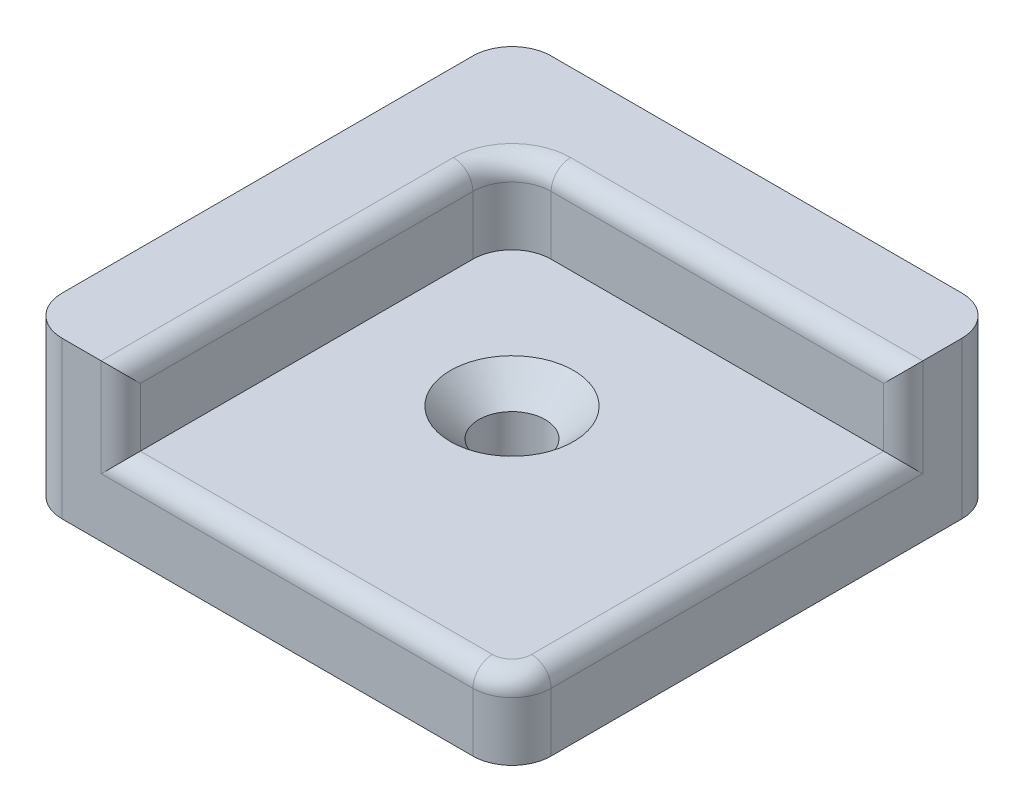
ISO-10303-21;
HEADER;
FILE_DESCRIPTION(('STEP AP214'),'2;1');
FILE_NAME('part.step','',(''),(''),'','','');
FILE_SCHEMA(('AUTOMOTIVE_DESIGN { 1 0 10303 214 1 1 1 1 }'));
ENDSEC;
DATA;
#1=APPLICATION_CONTEXT('core data for automotive mechanical design processes');
#2=APPLICATION_PROTOCOL_DEFINITION('international standard','automotive_design',2000,#1);
#3=PRODUCT_CONTEXT('',#1,'mechanical');
#4=PRODUCT('Part','Part','',(#3));
#5=PRODUCT_RELATED_PRODUCT_CATEGORY('part','',(#4));
#6=PRODUCT_DEFINITION_FORMATION('','',#4);
#7=PRODUCT_DEFINITION_CONTEXT('part definition',#1,'design');
#8=PRODUCT_DEFINITION('design','',#6,#7);
#9=PRODUCT_DEFINITION_SHAPE('','',#8);
#10=(LENGTH_UNIT() NAMED_UNIT(*) SI_UNIT(.MILLI.,.METRE.));
#11=(NAMED_UNIT(*) PLANE_ANGLE_UNIT() SI_UNIT($,.RADIAN.));
#12=(NAMED_UNIT(*) SI_UNIT($,.STERADIAN.) SOLID_ANGLE_UNIT());
#13=UNCERTAINTY_MEASURE_WITH_UNIT(LENGTH_MEASURE(1.E-05),#10,'distance_accuracy_value','');
#14=(GEOMETRIC_REPRESENTATION_CONTEXT(3) GLOBAL_UNCERTAINTY_ASSIGNED_CONTEXT((#13)) GLOBAL_UNIT_ASSIGNED_CONTEXT((#10,
#11,#12)) REPRESENTATION_CONTEXT('',''));
#15=CARTESIAN_POINT('',(0.,0.,0.));
#16=DIRECTION('',(0.,0.,1.));
#17=DIRECTION('',(1.,0.,0.));
#18=AXIS2_PLACEMENT_3D('',#15,#16,#17);
#19=CARTESIAN_POINT('',(12.5,4.,12.5));
#20=DIRECTION('',(-1.,0.,0.));
#21=DIRECTION('',(0.,0.,1.));
#22=AXIS2_PLACEMENT_3D('',#19,#20,#21);
#23=PLANE('',#22);
#24=DIRECTION('',(0.,1.,0.));
#25=VECTOR('',#24,1.);
#26=CARTESIAN_POINT('',(12.5,4.,-8.5));
#27=LINE('',#26,#25);
#28=CARTESIAN_POINT('',(12.5,4.,-8.5));
#29=VERTEX_POINT('',#28);
#30=CARTESIAN_POINT('',(12.5,-1.,-8.5));
#31=VERTEX_POINT('',#30);
#32=EDGE_CURVE('E252',#29,#31,#27,.F.);
#33=ORIENTED_EDGE('',*,*,#32,.T.);
#34=DIRECTION('',(0.,0.,-1.));
#35=VECTOR('',#34,1.);
#36=CARTESIAN_POINT('',(12.5,-1.,12.5));
#37=LINE('',#36,#35);
#38=CARTESIAN_POINT('',(12.5,-1.,10.5));
#39=VERTEX_POINT('',#38);
#40=EDGE_CURVE('E254',#31,#39,#37,.F.);
#41=ORIENTED_EDGE('',*,*,#40,.T.);
#42=DIRECTION('',(0.,-1.,0.));
#43=VECTOR('',#42,1.);
#44=CARTESIAN_POINT('',(12.5,4.,10.5));
#45=LINE('',#44,#43);
#46=CARTESIAN_POINT('',(12.5,-4.,10.5));
#47=VERTEX_POINT('',#46);
#48=EDGE_CURVE('E225',#39,#47,#45,.T.);
#49=ORIENTED_EDGE('',*,*,#48,.T.);
#50=DIRECTION('',(0.,0.,-1.));
#51=VECTOR('',#50,1.);
#52=CARTESIAN_POINT('',(12.5,-4.,12.5));
#53=LINE('',#52,#51);
#54=CARTESIAN_POINT('',(12.5,-4.,-10.5));
#55=VERTEX_POINT('',#54);
#56=EDGE_CURVE('E177',#47,#55,#53,.T.);
#57=ORIENTED_EDGE('',*,*,#56,.T.);
#58=DIRECTION('',(0.,-1.,0.));
#59=VECTOR('',#58,1.);
#60=CARTESIAN_POINT('',(12.5,4.,-10.5));
#61=LINE('',#60,#59);
#62=CARTESIAN_POINT('',(12.5,4.,-10.5));
#63=VERTEX_POINT('',#62);
#64=EDGE_CURVE('E227',#55,#63,#61,.F.);
#65=ORIENTED_EDGE('',*,*,#64,.T.);
#66=DIRECTION('',(0.,0.,-1.));
#67=VECTOR('',#66,1.);
#68=CARTESIAN_POINT('',(12.5,4.,12.5));
#69=LINE('',#68,#67);
#70=EDGE_CURVE('E179',#29,#63,#69,.T.);
#71=ORIENTED_EDGE('',*,*,#70,.F.);
#72=EDGE_LOOP('',(#33,#41,#49,#57,#65,#71));
#73=FACE_BOUND('',#72,.T.);
#74=ADVANCED_FACE('F35',(#73),#23,.F.);
#75=CARTESIAN_POINT('',(-12.5,4.,-12.5));
#76=DIRECTION('',(0.,0.,1.));
#77=DIRECTION('',(1.,0.,0.));
#78=AXIS2_PLACEMENT_3D('',#75,#76,#77);
#79=PLANE('',#78);
#80=DIRECTION('',(-1.,0.,0.));
#81=VECTOR('',#80,1.);
#82=CARTESIAN_POINT('',(-12.5,-4.,-12.5));
#83=LINE('',#82,#81);
#84=CARTESIAN_POINT('',(10.5,-4.,-12.5));
#85=VERTEX_POINT('',#84);
#86=CARTESIAN_POINT('',(-10.5,-4.,-12.5));
#87=VERTEX_POINT('',#86);
#88=EDGE_CURVE('E194',#85,#87,#83,.T.);
#89=ORIENTED_EDGE('',*,*,#88,.T.);
#90=DIRECTION('',(0.,-1.,0.));
#91=VECTOR('',#90,1.);
#92=CARTESIAN_POINT('',(-10.5,4.,-12.5));
#93=LINE('',#92,#91);
#94=CARTESIAN_POINT('',(-10.5,4.,-12.5));
#95=VERTEX_POINT('',#94);
#96=EDGE_CURVE('E217',#87,#95,#93,.F.);
#97=ORIENTED_EDGE('',*,*,#96,.T.);
#98=DIRECTION('',(-1.,0.,0.));
#99=VECTOR('',#98,1.);
#100=CARTESIAN_POINT('',(-12.5,4.,-12.5));
#101=LINE('',#100,#99);
#102=CARTESIAN_POINT('',(10.5,4.,-12.5));
#103=VERTEX_POINT('',#102);
#104=EDGE_CURVE('E181',#103,#95,#101,.T.);
#105=ORIENTED_EDGE('',*,*,#104,.F.);
#106=DIRECTION('',(0.,-1.,0.));
#107=VECTOR('',#106,1.);
#108=CARTESIAN_POINT('',(10.5,4.,-12.5));
#109=LINE('',#108,#107);
#110=EDGE_CURVE('E214',#103,#85,#109,.T.);
#111=ORIENTED_EDGE('',*,*,#110,.T.);
#112=EDGE_LOOP('',(#89,#97,#105,#111));
#113=FACE_BOUND('',#112,.T.);
#114=ADVANCED_FACE('F344',(#113),#79,.F.);
#115=CARTESIAN_POINT('',(-12.5,4.,12.5));
#116=DIRECTION('',(1.,0.,0.));
#117=DIRECTION('',(0.,0.,-1.));
#118=AXIS2_PLACEMENT_3D('',#115,#116,#117);
#119=PLANE('',#118);
#120=DIRECTION('',(0.,0.,1.));
#121=VECTOR('',#120,1.);
#122=CARTESIAN_POINT('',(-12.5,4.,12.5));
#123=LINE('',#122,#121);
#124=CARTESIAN_POINT('',(-12.5,4.,-10.5));
#125=VERTEX_POINT('',#124);
#126=CARTESIAN_POINT('',(-12.5,4.,10.5));
#127=VERTEX_POINT('',#126);
#128=EDGE_CURVE('E185',#125,#127,#123,.T.);
#129=ORIENTED_EDGE('',*,*,#128,.F.);
#130=DIRECTION('',(0.,-1.,0.));
#131=VECTOR('',#130,1.);
#132=CARTESIAN_POINT('',(-12.5,4.,-10.5));
#133=LINE('',#132,#131);
#134=CARTESIAN_POINT('',(-12.5,-4.,-10.5));
#135=VERTEX_POINT('',#134);
#136=EDGE_CURVE('E203',#125,#135,#133,.T.);
#137=ORIENTED_EDGE('',*,*,#136,.T.);
#138=DIRECTION('',(0.,0.,1.));
#139=VECTOR('',#138,1.);
#140=CARTESIAN_POINT('',(-12.5,-4.,12.5));
#141=LINE('',#140,#139);
#142=CARTESIAN_POINT('',(-12.5,-4.,10.5));
#143=VERTEX_POINT('',#142);
#144=EDGE_CURVE('E197',#135,#143,#141,.T.);
#145=ORIENTED_EDGE('',*,*,#144,.T.);
#146=DIRECTION('',(0.,-1.,0.));
#147=VECTOR('',#146,1.);
#148=CARTESIAN_POINT('',(-12.5,4.,10.5));
#149=LINE('',#148,#147);
#150=EDGE_CURVE('E191',#143,#127,#149,.F.);
#151=ORIENTED_EDGE('',*,*,#150,.T.);
#152=EDGE_LOOP('',(#129,#137,#145,#151));
#153=FACE_BOUND('',#152,.T.);
#154=ADVANCED_FACE('F351',(#153),#119,.F.);
#155=CARTESIAN_POINT('',(-12.5,4.,12.5));
#156=DIRECTION('',(0.,0.,-1.));
#157=DIRECTION('',(-1.,0.,0.));
#158=AXIS2_PLACEMENT_3D('',#155,#156,#157);
#159=PLANE('',#158);
#160=DIRECTION('',(0.,-1.,0.));
#161=VECTOR('',#160,1.);
#162=CARTESIAN_POINT('',(10.5,4.,12.5));
#163=LINE('',#162,#161);
#164=CARTESIAN_POINT('',(10.5,-4.,12.5));
#165=VERTEX_POINT('',#164);
#166=CARTESIAN_POINT('',(10.5,-1.,12.5));
#167=VERTEX_POINT('',#166);
#168=EDGE_CURVE('E230',#165,#167,#163,.F.);
#169=ORIENTED_EDGE('',*,*,#168,.T.);
#170=DIRECTION('',(1.,0.,0.));
#171=VECTOR('',#170,1.);
#172=CARTESIAN_POINT('',(-12.5,-1.,12.5));
#173=LINE('',#172,#171);
#174=CARTESIAN_POINT('',(-8.5,-1.,12.5));
#175=VERTEX_POINT('',#174);
#176=EDGE_CURVE('E11',#167,#175,#173,.F.);
#177=ORIENTED_EDGE('',*,*,#176,.T.);
#178=DIRECTION('',(0.,1.,0.));
#179=VECTOR('',#178,1.);
#180=CARTESIAN_POINT('',(-8.5,4.,12.5));
#181=LINE('',#180,#179);
#182=CARTESIAN_POINT('',(-8.5,4.,12.5));
#183=VERTEX_POINT('',#182);
#184=EDGE_CURVE('E44',#175,#183,#181,.T.);
#185=ORIENTED_EDGE('',*,*,#184,.T.);
#186=DIRECTION('',(1.,0.,0.));
#187=VECTOR('',#186,1.);
#188=CARTESIAN_POINT('',(-12.5,4.,12.5));
#189=LINE('',#188,#187);
#190=CARTESIAN_POINT('',(-10.5,4.,12.5));
#191=VERTEX_POINT('',#190);
#192=EDGE_CURVE('E188',#191,#183,#189,.T.);
#193=ORIENTED_EDGE('',*,*,#192,.F.);
#194=DIRECTION('',(0.,-1.,0.));
#195=VECTOR('',#194,1.);
#196=CARTESIAN_POINT('',(-10.5,4.,12.5));
#197=LINE('',#196,#195);
#198=CARTESIAN_POINT('',(-10.5,-4.,12.5));
#199=VERTEX_POINT('',#198);
#200=EDGE_CURVE('E232',#191,#199,#197,.T.);
#201=ORIENTED_EDGE('',*,*,#200,.T.);
#202=DIRECTION('',(1.,0.,0.));
#203=VECTOR('',#202,1.);
#204=CARTESIAN_POINT('',(-12.5,-4.,12.5));
#205=LINE('',#204,#203);
#206=EDGE_CURVE('E182',#199,#165,#205,.T.);
#207=ORIENTED_EDGE('',*,*,#206,.T.);
#208=EDGE_LOOP('',(#169,#177,#185,#193,#201,#207));
#209=FACE_BOUND('',#208,.T.);
#210=ADVANCED_FACE('F295',(#209),#159,.F.);
#211=CARTESIAN_POINT('',(0.,4.,0.));
#212=DIRECTION('',(0.,-1.,0.));
#213=DIRECTION('',(0.,0.,-1.));
#214=AXIS2_PLACEMENT_3D('',#211,#212,#213);
#215=PLANE('',#214);
#216=CARTESIAN_POINT('',(-5.5,4.,-5.5));
#217=DIRECTION('',(0.,-1.,0.));
#218=DIRECTION('',(0.,0.,-1.));
#219=AXIS2_PLACEMENT_3D('',#216,#217,#218);
#220=CIRCLE('',#219,3.);
#221=CARTESIAN_POINT('',(-8.5,4.,-5.5));
#222=VERTEX_POINT('',#221);
#223=CARTESIAN_POINT('',(-5.5,4.,-8.5));
#224=VERTEX_POINT('',#223);
#225=EDGE_CURVE('E240',#222,#224,#220,.T.);
#226=ORIENTED_EDGE('',*,*,#225,.T.);
#227=DIRECTION('',(-1.,0.,0.));
#228=VECTOR('',#227,1.);
#229=CARTESIAN_POINT('',(0.,4.,-8.5));
#230=LINE('',#229,#228);
#231=EDGE_CURVE('E242',#224,#29,#230,.F.);
#232=ORIENTED_EDGE('',*,*,#231,.T.);
#233=ORIENTED_EDGE('',*,*,#70,.T.);
#234=CARTESIAN_POINT('',(10.5,4.,-10.5));
#235=DIRECTION('',(0.,-1.,0.));
#236=DIRECTION('',(0.,0.,-1.));
#237=AXIS2_PLACEMENT_3D('',#234,#235,#236);
#238=CIRCLE('',#237,2.);
#239=EDGE_CURVE('E221',#63,#103,#238,.F.);
#240=ORIENTED_EDGE('',*,*,#239,.T.);
#241=ORIENTED_EDGE('',*,*,#104,.T.);
#242=CARTESIAN_POINT('',(-10.5,4.,-10.5));
#243=DIRECTION('',(0.,-1.,0.));
#244=DIRECTION('',(0.,0.,-1.));
#245=AXIS2_PLACEMENT_3D('',#242,#243,#244);
#246=CIRCLE('',#245,2.);
#247=EDGE_CURVE('E223',#95,#125,#246,.F.);
#248=ORIENTED_EDGE('',*,*,#247,.T.);
#249=ORIENTED_EDGE('',*,*,#128,.T.);
#250=CARTESIAN_POINT('',(-10.5,4.,10.5));
#251=DIRECTION('',(0.,-1.,0.));
#252=DIRECTION('',(0.,0.,-1.));
#253=AXIS2_PLACEMENT_3D('',#250,#251,#252);
#254=CIRCLE('',#253,2.);
#255=EDGE_CURVE('E219',#127,#191,#254,.F.);
#256=ORIENTED_EDGE('',*,*,#255,.T.);
#257=ORIENTED_EDGE('',*,*,#192,.T.);
#258=DIRECTION('',(0.,0.,1.));
#259=VECTOR('',#258,1.);
#260=CARTESIAN_POINT('',(-8.5,4.,0.));
#261=LINE('',#260,#259);
#262=EDGE_CURVE('E238',#183,#222,#261,.F.);
#263=ORIENTED_EDGE('',*,*,#262,.T.);
#264=EDGE_LOOP('',(#226,#232,#233,#240,#241,#248,#249,#256,#257,#263));
#265=FACE_BOUND('',#264,.T.);
#266=ADVANCED_FACE('F298',(#265),#215,.F.);
#267=CARTESIAN_POINT('',(0.,-4.,0.));
#268=DIRECTION('',(0.,-1.,0.));
#269=DIRECTION('',(0.,0.,-1.));
#270=AXIS2_PLACEMENT_3D('',#267,#268,#269);
#271=PLANE('',#270);
#272=CARTESIAN_POINT('',(0.,-4.,0.));
#273=DIRECTION('',(0.,1.,0.));
#274=DIRECTION('',(0.,0.,1.));
#275=AXIS2_PLACEMENT_3D('',#272,#273,#274);
#276=CIRCLE('',#275,1.7);
#277=CARTESIAN_POINT('',(0.,-4.,1.7));
#278=VERTEX_POINT('',#277);
#279=EDGE_CURVE('E265',#278,#278,#276,.T.);
#280=ORIENTED_EDGE('',*,*,#279,.T.);
#281=EDGE_LOOP('',(#280));
#282=FACE_BOUND('',#281,.T.);
#283=ORIENTED_EDGE('',*,*,#144,.F.);
#284=CARTESIAN_POINT('',(-10.5,-4.,-10.5));
#285=DIRECTION('',(0.,-1.,0.));
#286=DIRECTION('',(0.,0.,-1.));
#287=AXIS2_PLACEMENT_3D('',#284,#285,#286);
#288=CIRCLE('',#287,2.);
#289=EDGE_CURVE('E212',#135,#87,#288,.T.);
#290=ORIENTED_EDGE('',*,*,#289,.T.);
#291=ORIENTED_EDGE('',*,*,#88,.F.);
#292=CARTESIAN_POINT('',(10.5,-4.,-10.5));
#293=DIRECTION('',(0.,-1.,0.));
#294=DIRECTION('',(0.,0.,-1.));
#295=AXIS2_PLACEMENT_3D('',#292,#293,#294);
#296=CIRCLE('',#295,2.);
#297=EDGE_CURVE('E210',#85,#55,#296,.T.);
#298=ORIENTED_EDGE('',*,*,#297,.T.);
#299=ORIENTED_EDGE('',*,*,#56,.F.);
#300=CARTESIAN_POINT('',(10.5,-4.,10.5));
#301=DIRECTION('',(0.,-1.,0.));
#302=DIRECTION('',(0.,0.,-1.));
#303=AXIS2_PLACEMENT_3D('',#300,#301,#302);
#304=CIRCLE('',#303,2.);
#305=EDGE_CURVE('E206',#47,#165,#304,.T.);
#306=ORIENTED_EDGE('',*,*,#305,.T.);
#307=ORIENTED_EDGE('',*,*,#206,.F.);
#308=CARTESIAN_POINT('',(-10.5,-4.,10.5));
#309=DIRECTION('',(0.,-1.,0.));
#310=DIRECTION('',(0.,0.,-1.));
#311=AXIS2_PLACEMENT_3D('',#308,#309,#310);
#312=CIRCLE('',#311,2.);
#313=EDGE_CURVE('E208',#199,#143,#312,.T.);
#314=ORIENTED_EDGE('',*,*,#313,.T.);
#315=EDGE_LOOP('',(#283,#290,#291,#298,#299,#306,#307,#314));
#316=FACE_BOUND('',#315,.T.);
#317=ADVANCED_FACE('F309',(#282,#316),#271,.T.);
#318=CARTESIAN_POINT('',(-7.5,0.,12.5));
#319=DIRECTION('',(-1.,0.,0.));
#320=DIRECTION('',(0.,0.,1.));
#321=AXIS2_PLACEMENT_3D('',#318,#319,#320);
#322=PLANE('',#321);
#323=DIRECTION('',(0.,1.,0.));
#324=VECTOR('',#323,1.);
#325=CARTESIAN_POINT('',(-7.5,0.,-5.5));
#326=LINE('',#325,#324);
#327=CARTESIAN_POINT('',(-7.5,0.,-5.5));
#328=VERTEX_POINT('',#327);
#329=CARTESIAN_POINT('',(-7.5,3.,-5.5));
#330=VERTEX_POINT('',#329);
#331=EDGE_CURVE('E169',#328,#330,#326,.T.);
#332=ORIENTED_EDGE('',*,*,#331,.T.);
#333=DIRECTION('',(0.,0.,1.));
#334=VECTOR('',#333,1.);
#335=CARTESIAN_POINT('',(-7.5,3.,12.5));
#336=LINE('',#335,#334);
#337=CARTESIAN_POINT('',(-7.5,3.,11.5));
#338=VERTEX_POINT('',#337);
#339=EDGE_CURVE('E58',#330,#338,#336,.T.);
#340=ORIENTED_EDGE('',*,*,#339,.T.);
#341=DIRECTION('',(0.,1.,0.));
#342=VECTOR('',#341,1.);
#343=CARTESIAN_POINT('',(-7.5,0.,11.5));
#344=LINE('',#343,#342);
#345=CARTESIAN_POINT('',(-7.5,0.,11.5));
#346=VERTEX_POINT('',#345);
#347=EDGE_CURVE('E258',#338,#346,#344,.F.);
#348=ORIENTED_EDGE('',*,*,#347,.T.);
#349=DIRECTION('',(0.,0.,1.));
#350=VECTOR('',#349,1.);
#351=CARTESIAN_POINT('',(-7.5,0.,12.5));
#352=LINE('',#351,#350);
#353=EDGE_CURVE('E170',#328,#346,#352,.T.);
#354=ORIENTED_EDGE('',*,*,#353,.F.);
#355=EDGE_LOOP('',(#332,#340,#348,#354));
#356=FACE_BOUND('',#355,.T.);
#357=ADVANCED_FACE('F334',(#356),#322,.F.);
#358=CARTESIAN_POINT('',(-5.5,0.,-5.5));
#359=DIRECTION('',(0.,1.,0.));
#360=DIRECTION('',(0.,0.,1.));
#361=AXIS2_PLACEMENT_3D('',#358,#359,#360);
#362=CYLINDRICAL_SURFACE('',#361,2.);
#363=DIRECTION('',(0.,1.,0.));
#364=VECTOR('',#363,1.);
#365=CARTESIAN_POINT('',(-5.5,0.,-7.5));
#366=LINE('',#365,#364);
#367=CARTESIAN_POINT('',(-5.5,0.,-7.5));
#368=VERTEX_POINT('',#367);
#369=CARTESIAN_POINT('',(-5.5,3.,-7.5));
#370=VERTEX_POINT('',#369);
#371=EDGE_CURVE('E164',#368,#370,#366,.T.);
#372=ORIENTED_EDGE('',*,*,#371,.T.);
#373=CARTESIAN_POINT('',(-5.5,3.,-5.5));
#374=DIRECTION('',(0.,-1.,0.));
#375=DIRECTION('',(0.,0.,-1.));
#376=AXIS2_PLACEMENT_3D('',#373,#374,#375);
#377=CIRCLE('',#376,2.);
#378=EDGE_CURVE('E245',#370,#330,#377,.F.);
#379=ORIENTED_EDGE('',*,*,#378,.T.);
#380=ORIENTED_EDGE('',*,*,#331,.F.);
#381=CARTESIAN_POINT('',(-5.5,0.,-5.5));
#382=DIRECTION('',(0.,1.,0.));
#383=DIRECTION('',(0.,0.,-1.));
#384=AXIS2_PLACEMENT_3D('',#381,#382,#383);
#385=CIRCLE('',#384,2.);
#386=EDGE_CURVE('E155',#368,#328,#385,.T.);
#387=ORIENTED_EDGE('',*,*,#386,.F.);
#388=EDGE_LOOP('',(#372,#379,#380,#387));
#389=FACE_BOUND('',#388,.T.);
#390=ADVANCED_FACE('F172',(#389),#362,.F.);
#391=CARTESIAN_POINT('',(-5.5,0.,-7.5));
#392=DIRECTION('',(0.,0.,-1.));
#393=DIRECTION('',(-1.,0.,0.));
#394=AXIS2_PLACEMENT_3D('',#391,#392,#393);
#395=PLANE('',#394);
#396=DIRECTION('',(0.,1.,0.));
#397=VECTOR('',#396,1.);
#398=CARTESIAN_POINT('',(11.5,0.,-7.5));
#399=LINE('',#398,#397);
#400=CARTESIAN_POINT('',(11.5,0.,-7.5));
#401=VERTEX_POINT('',#400);
#402=CARTESIAN_POINT('',(11.5,3.,-7.5));
#403=VERTEX_POINT('',#402);
#404=EDGE_CURVE('E235',#401,#403,#399,.T.);
#405=ORIENTED_EDGE('',*,*,#404,.T.);
#406=DIRECTION('',(-1.,0.,0.));
#407=VECTOR('',#406,1.);
#408=CARTESIAN_POINT('',(-5.5,3.,-7.5));
#409=LINE('',#408,#407);
#410=EDGE_CURVE('E167',#403,#370,#409,.T.);
#411=ORIENTED_EDGE('',*,*,#410,.T.);
#412=ORIENTED_EDGE('',*,*,#371,.F.);
#413=DIRECTION('',(-1.,0.,0.));
#414=VECTOR('',#413,1.);
#415=CARTESIAN_POINT('',(-5.5,0.,-7.5));
#416=LINE('',#415,#414);
#417=EDGE_CURVE('E150',#401,#368,#416,.T.);
#418=ORIENTED_EDGE('',*,*,#417,.F.);
#419=EDGE_LOOP('',(#405,#411,#412,#418));
#420=FACE_BOUND('',#419,.T.);
#421=ADVANCED_FACE('F165',(#420),#395,.F.);
#422=CARTESIAN_POINT('',(-5.5,0.,-5.5));
#423=DIRECTION('',(0.,-1.,0.));
#424=DIRECTION('',(0.,0.,-1.));
#425=AXIS2_PLACEMENT_3D('',#422,#423,#424);
#426=PLANE('',#425);
#427=CARTESIAN_POINT('',(0.,0.,0.));
#428=DIRECTION('',(0.,1.,0.));
#429=DIRECTION('',(0.,0.,1.));
#430=AXIS2_PLACEMENT_3D('',#427,#428,#429);
#431=CIRCLE('',#430,3.15);
#432=CARTESIAN_POINT('',(0.,0.,3.15));
#433=VERTEX_POINT('',#432);
#434=EDGE_CURVE('E556',#433,#433,#431,.T.);
#435=ORIENTED_EDGE('',*,*,#434,.F.);
#436=EDGE_LOOP('',(#435));
#437=FACE_BOUND('',#436,.T.);
#438=CARTESIAN_POINT('',(10.5,0.,10.5));
#439=DIRECTION('',(0.,-1.,0.));
#440=DIRECTION('',(0.,0.,-1.));
#441=AXIS2_PLACEMENT_3D('',#438,#439,#440);
#442=CIRCLE('',#441,1.);
#443=CARTESIAN_POINT('',(10.5,0.,11.5));
#444=VERTEX_POINT('',#443);
#445=CARTESIAN_POINT('',(11.5,0.,10.5));
#446=VERTEX_POINT('',#445);
#447=EDGE_CURVE('E249',#444,#446,#442,.F.);
#448=ORIENTED_EDGE('',*,*,#447,.T.);
#449=DIRECTION('',(0.,0.,-1.));
#450=VECTOR('',#449,1.);
#451=CARTESIAN_POINT('',(11.5,0.,-5.5));
#452=LINE('',#451,#450);
#453=EDGE_CURVE('E158',#446,#401,#452,.T.);
#454=ORIENTED_EDGE('',*,*,#453,.T.);
#455=ORIENTED_EDGE('',*,*,#417,.T.);
#456=ORIENTED_EDGE('',*,*,#386,.T.);
#457=ORIENTED_EDGE('',*,*,#353,.T.);
#458=DIRECTION('',(1.,0.,0.));
#459=VECTOR('',#458,1.);
#460=CARTESIAN_POINT('',(-5.5,0.,11.5));
#461=LINE('',#460,#459);
#462=EDGE_CURVE('E247',#346,#444,#461,.T.);
#463=ORIENTED_EDGE('',*,*,#462,.T.);
#464=EDGE_LOOP('',(#448,#454,#455,#456,#457,#463));
#465=FACE_BOUND('',#464,.T.);
#466=ADVANCED_FACE('F152',(#437,#465),#426,.F.);
#467=CARTESIAN_POINT('',(-10.5,4.,-10.5));
#468=DIRECTION('',(0.,-1.,0.));
#469=DIRECTION('',(0.,0.,-1.));
#470=AXIS2_PLACEMENT_3D('',#467,#468,#469);
#471=CYLINDRICAL_SURFACE('',#470,2.);
#472=ORIENTED_EDGE('',*,*,#247,.F.);
#473=ORIENTED_EDGE('',*,*,#96,.F.);
#474=ORIENTED_EDGE('',*,*,#289,.F.);
#475=ORIENTED_EDGE('',*,*,#136,.F.);
#476=EDGE_LOOP('',(#472,#473,#474,#475));
#477=FACE_BOUND('',#476,.T.);
#478=ADVANCED_FACE('F348',(#477),#471,.T.);
#479=CARTESIAN_POINT('',(10.5,4.,-10.5));
#480=DIRECTION('',(0.,-1.,0.));
#481=DIRECTION('',(0.,0.,-1.));
#482=AXIS2_PLACEMENT_3D('',#479,#480,#481);
#483=CYLINDRICAL_SURFACE('',#482,2.);
#484=ORIENTED_EDGE('',*,*,#239,.F.);
#485=ORIENTED_EDGE('',*,*,#64,.F.);
#486=ORIENTED_EDGE('',*,*,#297,.F.);
#487=ORIENTED_EDGE('',*,*,#110,.F.);
#488=EDGE_LOOP('',(#484,#485,#486,#487));
#489=FACE_BOUND('',#488,.T.);
#490=ADVANCED_FACE('F340',(#489),#483,.T.);
#491=CARTESIAN_POINT('',(-10.5,4.,10.5));
#492=DIRECTION('',(0.,-1.,0.));
#493=DIRECTION('',(0.,0.,-1.));
#494=AXIS2_PLACEMENT_3D('',#491,#492,#493);
#495=CYLINDRICAL_SURFACE('',#494,2.);
#496=ORIENTED_EDGE('',*,*,#255,.F.);
#497=ORIENTED_EDGE('',*,*,#150,.F.);
#498=ORIENTED_EDGE('',*,*,#313,.F.);
#499=ORIENTED_EDGE('',*,*,#200,.F.);
#500=EDGE_LOOP('',(#496,#497,#498,#499));
#501=FACE_BOUND('',#500,.T.);
#502=ADVANCED_FACE('F304',(#501),#495,.T.);
#503=CARTESIAN_POINT('',(10.5,4.,10.5));
#504=DIRECTION('',(0.,-1.,0.));
#505=DIRECTION('',(0.,0.,-1.));
#506=AXIS2_PLACEMENT_3D('',#503,#504,#505);
#507=CYLINDRICAL_SURFACE('',#506,2.);
#508=ORIENTED_EDGE('',*,*,#48,.F.);
#509=CARTESIAN_POINT('',(10.5,-1.,10.5));
#510=DIRECTION('',(0.,-1.,0.));
#511=DIRECTION('',(0.,0.,-1.));
#512=AXIS2_PLACEMENT_3D('',#509,#510,#511);
#513=CIRCLE('',#512,2.);
#514=EDGE_CURVE('E256',#39,#167,#513,.T.);
#515=ORIENTED_EDGE('',*,*,#514,.T.);
#516=ORIENTED_EDGE('',*,*,#168,.F.);
#517=ORIENTED_EDGE('',*,*,#305,.F.);
#518=EDGE_LOOP('',(#508,#515,#516,#517));
#519=FACE_BOUND('',#518,.T.);
#520=ADVANCED_FACE('F314',(#519),#507,.T.);
#521=CARTESIAN_POINT('',(-5.5,-1.,11.5));
#522=DIRECTION('',(1.,0.,0.));
#523=DIRECTION('',(0.,0.,-1.));
#524=AXIS2_PLACEMENT_3D('',#521,#522,#523);
#525=CYLINDRICAL_SURFACE('',#524,1.);
#526=CARTESIAN_POINT('',(-8.5,-1.,11.5));
#527=DIRECTION('',(0.707106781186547,-0.707106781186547,0.));
#528=DIRECTION('',(0.707106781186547,0.707106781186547,0.));
#529=AXIS2_PLACEMENT_3D('',#526,#527,#528);
#530=ELLIPSE('',#529,1.41421356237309,1.);
#531=EDGE_CURVE('E278',#175,#346,#530,.F.);
#532=ORIENTED_EDGE('',*,*,#531,.F.);
#533=ORIENTED_EDGE('',*,*,#176,.F.);
#534=CARTESIAN_POINT('',(10.5,-1.,11.5));
#535=DIRECTION('',(1.,0.,0.));
#536=DIRECTION('',(0.,0.,-1.));
#537=AXIS2_PLACEMENT_3D('',#534,#535,#536);
#538=CIRCLE('',#537,1.);
#539=EDGE_CURVE('E39',#444,#167,#538,.T.);
#540=ORIENTED_EDGE('',*,*,#539,.F.);
#541=ORIENTED_EDGE('',*,*,#462,.F.);
#542=EDGE_LOOP('',(#532,#533,#540,#541));
#543=FACE_BOUND('',#542,.T.);
#544=ADVANCED_FACE('F37',(#543),#525,.T.);
#545=CARTESIAN_POINT('',(10.5,-1.,10.5));
#546=DIRECTION('',(0.,-1.,0.));
#547=DIRECTION('',(0.,0.,-1.));
#548=AXIS2_PLACEMENT_3D('',#545,#546,#547);
#549=DEGENERATE_TOROIDAL_SURFACE('',#548,1.,1.,.T.);
#550=ORIENTED_EDGE('',*,*,#539,.T.);
#551=ORIENTED_EDGE('',*,*,#514,.F.);
#552=CARTESIAN_POINT('',(11.5,-1.,10.5));
#553=DIRECTION('',(0.,0.,-1.));
#554=DIRECTION('',(-1.,0.,0.));
#555=AXIS2_PLACEMENT_3D('',#552,#553,#554);
#556=CIRCLE('',#555,1.);
#557=EDGE_CURVE('E276',#446,#39,#556,.T.);
#558=ORIENTED_EDGE('',*,*,#557,.F.);
#559=ORIENTED_EDGE('',*,*,#447,.F.);
#560=EDGE_LOOP('',(#550,#551,#558,#559));
#561=FACE_BOUND('',#560,.T.);
#562=ADVANCED_FACE('F287',(#561),#549,.T.);
#563=CARTESIAN_POINT('',(-8.5,4.,11.5));
#564=DIRECTION('',(0.,1.,0.));
#565=DIRECTION('',(0.,0.,1.));
#566=AXIS2_PLACEMENT_3D('',#563,#564,#565);
#567=CYLINDRICAL_SURFACE('',#566,1.);
#568=ORIENTED_EDGE('',*,*,#531,.T.);
#569=ORIENTED_EDGE('',*,*,#347,.F.);
#570=CARTESIAN_POINT('',(-8.5,3.,11.5));
#571=DIRECTION('',(0.,0.707106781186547,-0.707106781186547));
#572=DIRECTION('',(0.,0.707106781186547,0.707106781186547));
#573=AXIS2_PLACEMENT_3D('',#570,#571,#572);
#574=ELLIPSE('',#573,1.41421356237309,1.);
#575=EDGE_CURVE('E273',#183,#338,#574,.T.);
#576=ORIENTED_EDGE('',*,*,#575,.F.);
#577=ORIENTED_EDGE('',*,*,#184,.F.);
#578=EDGE_LOOP('',(#568,#569,#576,#577));
#579=FACE_BOUND('',#578,.T.);
#580=ADVANCED_FACE('F292',(#579),#567,.T.);
#581=CARTESIAN_POINT('',(11.5,-1.,-5.5));
#582=DIRECTION('',(0.,0.,-1.));
#583=DIRECTION('',(-1.,0.,0.));
#584=AXIS2_PLACEMENT_3D('',#581,#582,#583);
#585=CYLINDRICAL_SURFACE('',#584,1.);
#586=ORIENTED_EDGE('',*,*,#557,.T.);
#587=ORIENTED_EDGE('',*,*,#40,.F.);
#588=CARTESIAN_POINT('',(11.5,-1.,-8.5));
#589=DIRECTION('',(0.,0.707106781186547,-0.707106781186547));
#590=DIRECTION('',(0.,-0.707106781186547,-0.707106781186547));
#591=AXIS2_PLACEMENT_3D('',#588,#589,#590);
#592=ELLIPSE('',#591,1.41421356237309,1.);
#593=EDGE_CURVE('E270',#401,#31,#592,.T.);
#594=ORIENTED_EDGE('',*,*,#593,.F.);
#595=ORIENTED_EDGE('',*,*,#453,.F.);
#596=EDGE_LOOP('',(#586,#587,#594,#595));
#597=FACE_BOUND('',#596,.T.);
#598=ADVANCED_FACE('F321',(#597),#585,.T.);
#599=CARTESIAN_POINT('',(-8.5,3.,12.5));
#600=DIRECTION('',(0.,0.,1.));
#601=DIRECTION('',(1.,0.,0.));
#602=AXIS2_PLACEMENT_3D('',#599,#600,#601);
#603=CYLINDRICAL_SURFACE('',#602,1.);
#604=ORIENTED_EDGE('',*,*,#575,.T.);
#605=ORIENTED_EDGE('',*,*,#339,.F.);
#606=CARTESIAN_POINT('',(-8.5,3.,-5.5));
#607=DIRECTION('',(0.,0.,-1.));
#608=DIRECTION('',(-1.,0.,0.));
#609=AXIS2_PLACEMENT_3D('',#606,#607,#608);
#610=CIRCLE('',#609,1.);
#611=EDGE_CURVE('E267',#222,#330,#610,.T.);
#612=ORIENTED_EDGE('',*,*,#611,.F.);
#613=ORIENTED_EDGE('',*,*,#262,.F.);
#614=EDGE_LOOP('',(#604,#605,#612,#613));
#615=FACE_BOUND('',#614,.T.);
#616=ADVANCED_FACE('F336',(#615),#603,.T.);
#617=CARTESIAN_POINT('',(11.5,0.,-8.5));
#618=DIRECTION('',(0.,1.,0.));
#619=DIRECTION('',(0.,0.,1.));
#620=AXIS2_PLACEMENT_3D('',#617,#618,#619);
#621=CYLINDRICAL_SURFACE('',#620,1.);
#622=ORIENTED_EDGE('',*,*,#593,.T.);
#623=ORIENTED_EDGE('',*,*,#32,.F.);
#624=CARTESIAN_POINT('',(11.5,3.,-8.5));
#625=DIRECTION('',(-0.707106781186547,0.707106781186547,0.));
#626=DIRECTION('',(0.707106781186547,0.707106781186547,0.));
#627=AXIS2_PLACEMENT_3D('',#624,#625,#626);
#628=ELLIPSE('',#627,1.41421356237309,1.);
#629=EDGE_CURVE('E264',#403,#29,#628,.T.);
#630=ORIENTED_EDGE('',*,*,#629,.F.);
#631=ORIENTED_EDGE('',*,*,#404,.F.);
#632=EDGE_LOOP('',(#622,#623,#630,#631));
#633=FACE_BOUND('',#632,.T.);
#634=ADVANCED_FACE('F324',(#633),#621,.T.);
#635=CARTESIAN_POINT('',(-5.5,3.,-5.5));
#636=DIRECTION('',(0.,-1.,0.));
#637=DIRECTION('',(0.,0.,-1.));
#638=AXIS2_PLACEMENT_3D('',#635,#636,#637);
#639=TOROIDAL_SURFACE('',#638,3.,1.);
#640=ORIENTED_EDGE('',*,*,#611,.T.);
#641=ORIENTED_EDGE('',*,*,#378,.F.);
#642=CARTESIAN_POINT('',(-5.5,3.,-8.5));
#643=DIRECTION('',(1.,0.,0.));
#644=DIRECTION('',(0.,0.,-1.));
#645=AXIS2_PLACEMENT_3D('',#642,#643,#644);
#646=CIRCLE('',#645,1.);
#647=EDGE_CURVE('E262',#224,#370,#646,.T.);
#648=ORIENTED_EDGE('',*,*,#647,.F.);
#649=ORIENTED_EDGE('',*,*,#225,.F.);
#650=EDGE_LOOP('',(#640,#641,#648,#649));
#651=FACE_BOUND('',#650,.T.);
#652=ADVANCED_FACE('F333',(#651),#639,.T.);
#653=CARTESIAN_POINT('',(-5.5,3.,-8.5));
#654=DIRECTION('',(-1.,0.,0.));
#655=DIRECTION('',(0.,0.,1.));
#656=AXIS2_PLACEMENT_3D('',#653,#654,#655);
#657=CYLINDRICAL_SURFACE('',#656,1.);
#658=ORIENTED_EDGE('',*,*,#629,.T.);
#659=ORIENTED_EDGE('',*,*,#231,.F.);
#660=ORIENTED_EDGE('',*,*,#647,.T.);
#661=ORIENTED_EDGE('',*,*,#410,.F.);
#662=EDGE_LOOP('',(#658,#659,#660,#661));
#663=FACE_BOUND('',#662,.T.);
#664=ADVANCED_FACE('F328',(#663),#657,.T.);
#665=CARTESIAN_POINT('',(0.,0.,0.));
#666=DIRECTION('',(0.,1.,0.));
#667=DIRECTION('',(0.,0.,1.));
#668=AXIS2_PLACEMENT_3D('',#665,#666,#667);
#669=CYLINDRICAL_SURFACE('',#668,1.7);
#670=ORIENTED_EDGE('',*,*,#279,.F.);
#671=EDGE_LOOP('',(#670));
#672=FACE_BOUND('',#671,.T.);
#673=CARTESIAN_POINT('',(0.,-1.45,0.));
#674=DIRECTION('',(0.,1.,0.));
#675=DIRECTION('',(0.,0.,1.));
#676=AXIS2_PLACEMENT_3D('',#673,#674,#675);
#677=CIRCLE('',#676,1.7);
#678=CARTESIAN_POINT('',(0.,-1.45,1.7));
#679=VERTEX_POINT('',#678);
#680=EDGE_CURVE('E553',#679,#679,#677,.T.);
#681=ORIENTED_EDGE('',*,*,#680,.T.);
#682=EDGE_LOOP('',(#681));
#683=FACE_BOUND('',#682,.T.);
#684=ADVANCED_FACE('F375',(#672,#683),#669,.F.);
#685=CARTESIAN_POINT('',(0.,0.,0.));
#686=DIRECTION('',(0.,1.,0.));
#687=DIRECTION('',(0.,0.,1.));
#688=AXIS2_PLACEMENT_3D('',#685,#686,#687);
#689=CONICAL_SURFACE('',#688,3.15,0.785398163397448);
#690=ORIENTED_EDGE('',*,*,#680,.F.);
#691=EDGE_LOOP('',(#690));
#692=FACE_BOUND('',#691,.T.);
#693=ORIENTED_EDGE('',*,*,#434,.T.);
#694=EDGE_LOOP('',(#693));
#695=FACE_BOUND('',#694,.T.);
#696=ADVANCED_FACE('F531',(#692,#695),#689,.F.);
#697=CLOSED_SHELL('',(#74,#114,#154,#210,#266,#317,#357,#390,#421,#466,#478,#490,#502,#520,#544,
#562,#580,#598,#616,#634,#652,#664,#684,#696));
#698=MANIFOLD_SOLID_BREP('B2',#697);
#699=ADVANCED_BREP_SHAPE_REPRESENTATION('',(#18,#698),#14);
#700=SHAPE_DEFINITION_REPRESENTATION(#9,#699);
ENDSEC;
END-ISO-10303-21;
